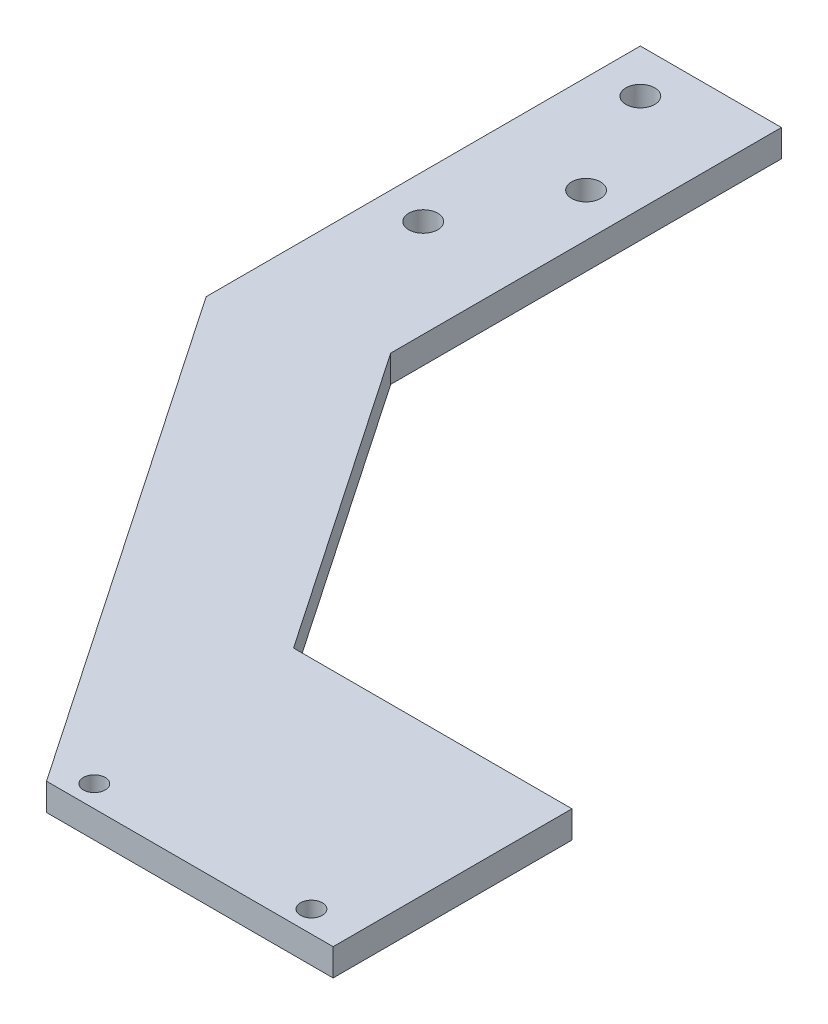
from build123d import *

# Parameters (mm, degrees)
BOSS_EXTRUDE1_DEPTH         = 6.35
F_1_4_CLEARANCE_HOLE1_D     = 6.7564
F_1_4_CLEARANCE_HOLE1_DEPTH = 16.51
F_1_4_CLEARANCE_HOLE1_TIP   = 2.029827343
F_10_CLEARANCE_HOLE1_D      = 5.1054
F_10_CLEARANCE_HOLE1_DEPTH  = 16.51
F_10_CLEARANCE_HOLE1_TIP    = 1.533816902


with BuildPart() as part:
    # Sketch1 → Boss-Extrude1 (new body)
    with BuildSketch(Plane(origin=(0, 0, 0), x_dir=(1, 0, 0), z_dir=(0, 1, 0))):
        Polygon((0, 0), (33.02, 0), (33.02, -91.431395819), (81.418376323, -162.56), (146.558, -162.56), (146.558, -218.44), (79.502, -218.44), (0, -101.6), align=None)
    extrude(amount=BOSS_EXTRUDE1_DEPTH)

    # 1_4 Clearance Hole1
    with Locations(Plane(origin=(0, 6.35, 0), x_dir=(1, 0, 0), z_dir=(0, 1, 0))):
        with Locations((10.16, -10.16), (22.86, -35.56), (10.16, -60.96)):
            Hole(F_1_4_CLEARANCE_HOLE1_D / 2, depth=F_1_4_CLEARANCE_HOLE1_DEPTH)
            with Locations((0, 0, -(F_1_4_CLEARANCE_HOLE1_DEPTH + F_1_4_CLEARANCE_HOLE1_TIP / 2))):  # 118° drill point
                Cone(0, F_1_4_CLEARANCE_HOLE1_D / 2, F_1_4_CLEARANCE_HOLE1_TIP, mode=Mode.SUBTRACT)

    # 10 Clearance Hole1
    with Locations(Plane(origin=(0, 6.35, 0), x_dir=(1, 0, 0), z_dir=(0, 1, 0))):
        with Locations((85.598, -213.36), (136.398, -213.36)):
            Hole(F_10_CLEARANCE_HOLE1_D / 2, depth=F_10_CLEARANCE_HOLE1_DEPTH)
            with Locations((0, 0, -(F_10_CLEARANCE_HOLE1_DEPTH + F_10_CLEARANCE_HOLE1_TIP / 2))):  # 118° drill point
                Cone(0, F_10_CLEARANCE_HOLE1_D / 2, F_10_CLEARANCE_HOLE1_TIP, mode=Mode.SUBTRACT)


solid = part.part
